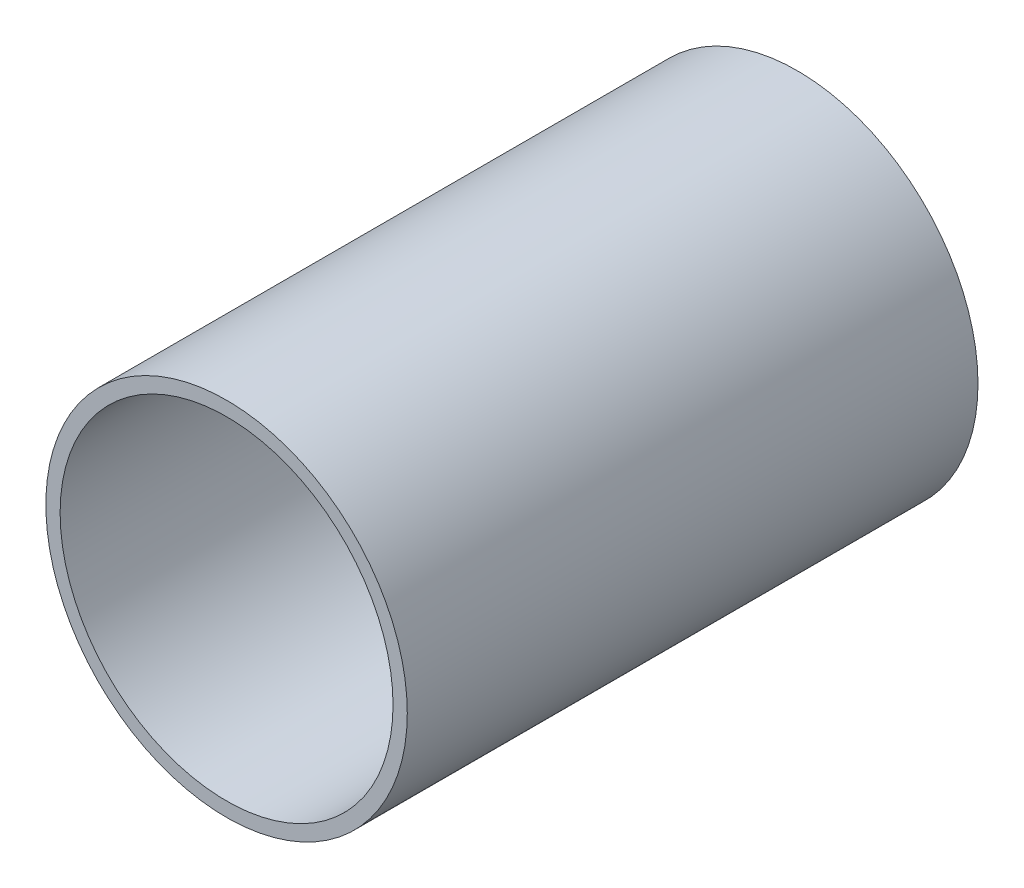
from build123d import *

# Parameters (mm, degrees)
ESQUISSE1_R          = 19
ESQUISSE1_R_2        = 17.5
BASE_EXTRUSION_DEPTH = 60


with BuildPart() as part:
    # Esquisse1 → Base-Extrusion (new body)
    with BuildSketch(Plane.XY):
        Circle(ESQUISSE1_R)
        Circle(ESQUISSE1_R_2, mode=Mode.SUBTRACT)
    extrude(amount=BASE_EXTRUSION_DEPTH)


solid = part.part
